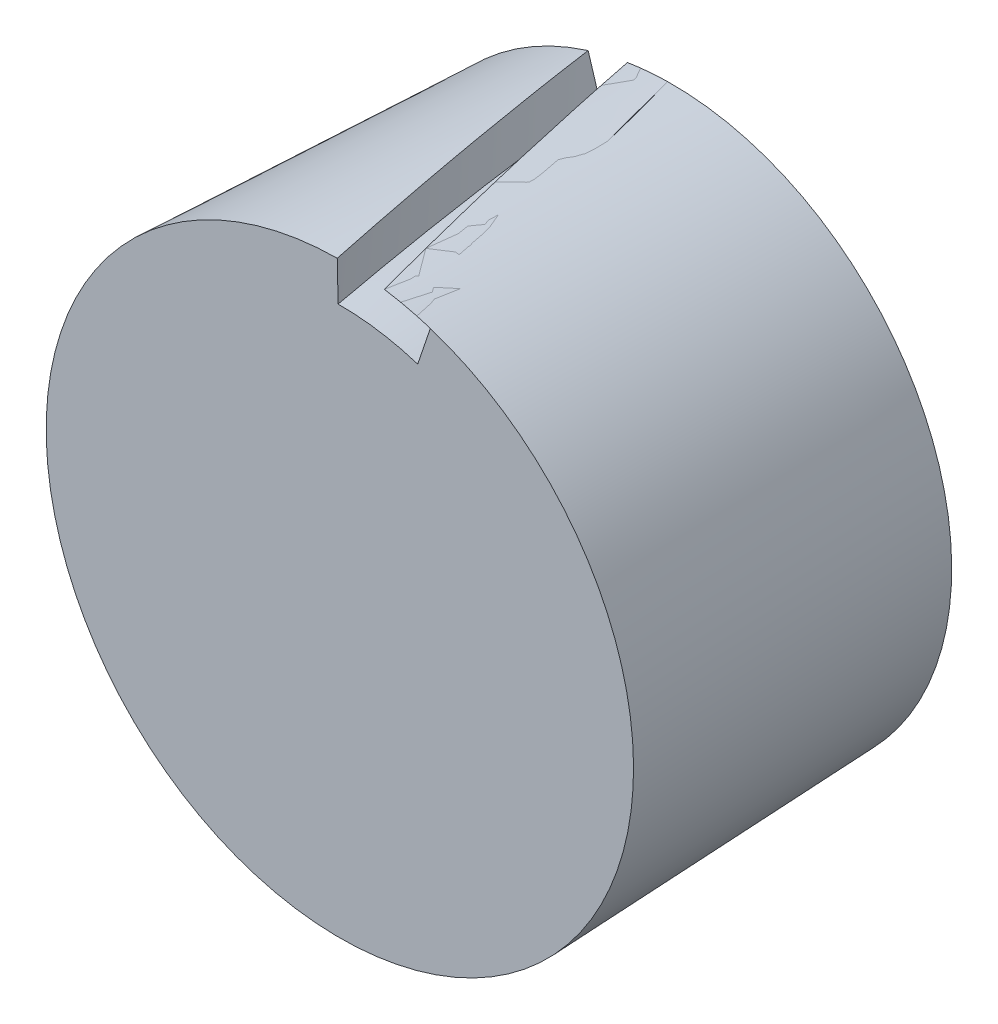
ISO-10303-21;
HEADER;
FILE_DESCRIPTION(('STEP AP214'),'2;1');
FILE_NAME('part.step','',(''),(''),'','','');
FILE_SCHEMA(('AUTOMOTIVE_DESIGN { 1 0 10303 214 1 1 1 1 }'));
ENDSEC;
DATA;
#1=APPLICATION_CONTEXT('core data for automotive mechanical design processes');
#2=APPLICATION_PROTOCOL_DEFINITION('international standard','automotive_design',2000,#1);
#3=PRODUCT_CONTEXT('',#1,'mechanical');
#4=PRODUCT('Part','Part','',(#3));
#5=PRODUCT_RELATED_PRODUCT_CATEGORY('part','',(#4));
#6=PRODUCT_DEFINITION_FORMATION('','',#4);
#7=PRODUCT_DEFINITION_CONTEXT('part definition',#1,'design');
#8=PRODUCT_DEFINITION('design','',#6,#7);
#9=PRODUCT_DEFINITION_SHAPE('','',#8);
#10=(LENGTH_UNIT() NAMED_UNIT(*) SI_UNIT(.MILLI.,.METRE.));
#11=(NAMED_UNIT(*) PLANE_ANGLE_UNIT() SI_UNIT($,.RADIAN.));
#12=(NAMED_UNIT(*) SI_UNIT($,.STERADIAN.) SOLID_ANGLE_UNIT());
#13=UNCERTAINTY_MEASURE_WITH_UNIT(LENGTH_MEASURE(1.E-05),#10,'distance_accuracy_value','');
#14=(GEOMETRIC_REPRESENTATION_CONTEXT(3) GLOBAL_UNCERTAINTY_ASSIGNED_CONTEXT((#13)) GLOBAL_UNIT_ASSIGNED_CONTEXT((#10,
#11,#12)) REPRESENTATION_CONTEXT('',''));
#15=CARTESIAN_POINT('',(0.,0.,0.));
#16=DIRECTION('',(0.,0.,1.));
#17=DIRECTION('',(1.,0.,0.));
#18=AXIS2_PLACEMENT_3D('',#15,#16,#17);
#19=CARTESIAN_POINT('',(0.,0.,63.5));
#20=DIRECTION('',(0.,0.,1.));
#21=DIRECTION('',(1.,0.,0.));
#22=AXIS2_PLACEMENT_3D('',#19,#20,#21);
#23=PLANE('',#22);
#24=DIRECTION('',(0.320823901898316,0.947138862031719,0.));
#25=VECTOR('',#24,1.);
#26=CARTESIAN_POINT('',(34.5958052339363,106.862336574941,63.5));
#27=LINE('',#26,#25);
#28=CARTESIAN_POINT('',(29.7755996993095,92.6320876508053,63.5));
#29=VERTEX_POINT('',#28);
#30=CARTESIAN_POINT('',(34.5958052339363,106.862336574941,63.5));
#31=VERTEX_POINT('',#30);
#32=EDGE_CURVE('E195',#29,#31,#27,.T.);
#33=ORIENTED_EDGE('',*,*,#32,.F.);
#34=CARTESIAN_POINT('',(0.,0.,63.5));
#35=DIRECTION('',(0.,0.,-1.));
#36=DIRECTION('',(1.,0.,0.));
#37=AXIS2_PLACEMENT_3D('',#34,#35,#36);
#38=CIRCLE('',#37,97.3);
#39=CARTESIAN_POINT('',(-0.668973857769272,97.2977002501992,63.5));
#40=VERTEX_POINT('',#39);
#41=EDGE_CURVE('E360',#40,#29,#38,.T.);
#42=ORIENTED_EDGE('',*,*,#41,.F.);
#43=DIRECTION('',(0.0224647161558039,-0.999747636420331,0.));
#44=VECTOR('',#43,1.);
#45=CARTESIAN_POINT('',(-0.668973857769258,97.2977002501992,63.5));
#46=LINE('',#45,#44);
#47=CARTESIAN_POINT('',(-1.0064940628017,112.318367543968,63.5));
#48=VERTEX_POINT('',#47);
#49=EDGE_CURVE('E190',#48,#40,#46,.T.);
#50=ORIENTED_EDGE('',*,*,#49,.F.);
#51=CARTESIAN_POINT('',(0.,0.,63.5));
#52=DIRECTION('',(0.,0.,1.));
#53=DIRECTION('',(1.,0.,0.));
#54=AXIS2_PLACEMENT_3D('',#51,#52,#53);
#55=CIRCLE('',#54,112.32287709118);
#56=EDGE_CURVE('E220',#48,#31,#55,.T.);
#57=ORIENTED_EDGE('',*,*,#56,.T.);
#58=EDGE_LOOP('',(#33,#42,#50,#57));
#59=FACE_BOUND('',#58,.T.);
#60=ADVANCED_FACE('F121',(#59),#23,.T.);
#61=CARTESIAN_POINT('',(0.,0.,-63.5));
#62=DIRECTION('',(0.,0.,1.));
#63=DIRECTION('',(1.,0.,0.));
#64=AXIS2_PLACEMENT_3D('',#61,#62,#63);
#65=CONICAL_SURFACE('',#64,107.,0.041887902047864);
#66=CARTESIAN_POINT('',(-17.0147737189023,105.638522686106,-63.4999999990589));
#67=CARTESIAN_POINT('',(-16.9802353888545,105.644172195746,-63.497961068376));
#68=CARTESIAN_POINT('',(-16.9456863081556,105.649800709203,-63.4960477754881));
#69=CARTESIAN_POINT('',(-16.8765691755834,105.661015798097,-63.4924608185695));
#70=CARTESIAN_POINT('',(-16.8420011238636,105.666602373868,-63.490787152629));
#71=CARTESIAN_POINT('',(-16.7728494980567,105.67773349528,-63.4876678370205));
#72=CARTESIAN_POINT('',(-16.7382659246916,105.683278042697,-63.486222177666));
#73=CARTESIAN_POINT('',(-16.6690843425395,105.694325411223,-63.4835472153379));
#74=CARTESIAN_POINT('',(-16.634486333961,105.699828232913,-63.4823179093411));
#75=CARTESIAN_POINT('',(-16.4110148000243,105.735230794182,-63.4750397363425));
#76=CARTESIAN_POINT('',(-16.2219472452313,105.764534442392,-63.4719351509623));
#77=CARTESIAN_POINT('',(-15.8436073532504,105.82195502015,-63.4699603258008));
#78=CARTESIAN_POINT('',(-15.6543349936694,105.850071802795,-63.4710906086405));
#79=CARTESIAN_POINT('',(-15.2755780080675,105.905194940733,-63.4758109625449));
#80=CARTESIAN_POINT('',(-15.0860933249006,105.932200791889,-63.4794021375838));
#81=CARTESIAN_POINT('',(-14.7070024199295,105.985159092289,-63.4873747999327));
#82=CARTESIAN_POINT('',(-14.5173962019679,106.011111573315,-63.4917562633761));
#83=CARTESIAN_POINT('',(-14.1379875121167,106.06203981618,-63.4997393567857));
#84=CARTESIAN_POINT('',(-13.9481850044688,106.087015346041,-63.5033408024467));
#85=CARTESIAN_POINT('',(-13.6633712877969,106.123786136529,-63.5070757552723));
#86=CARTESIAN_POINT('',(-13.5684162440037,106.135927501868,-63.5080428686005));
#87=CARTESIAN_POINT('',(-13.3784734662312,106.159986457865,-63.5092412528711));
#88=CARTESIAN_POINT('',(-13.2834857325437,106.171904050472,-63.5094725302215));
#89=CARTESIAN_POINT('',(-13.0934798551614,106.195519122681,-63.509105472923));
#90=CARTESIAN_POINT('',(-12.9984617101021,106.207216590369,-63.508507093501));
#91=CARTESIAN_POINT('',(-12.808398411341,106.230370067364,-63.5069761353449));
#92=CARTESIAN_POINT('',(-12.7133532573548,106.241826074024,-63.5060435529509));
#93=CARTESIAN_POINT('',(-12.4281676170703,106.275814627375,-63.5031815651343));
#94=CARTESIAN_POINT('',(-12.2379821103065,106.297967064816,-63.501187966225));
#95=CARTESIAN_POINT('',(-11.8573947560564,106.341221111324,-63.4981690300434));
#96=CARTESIAN_POINT('',(-11.6669928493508,106.362322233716,-63.4971441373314));
#97=CARTESIAN_POINT('',(-11.2860718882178,106.403455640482,-63.4961989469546));
#98=CARTESIAN_POINT('',(-11.0955528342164,106.423487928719,-63.4962786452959));
#99=CARTESIAN_POINT('',(-10.7144313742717,106.462494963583,-63.4971922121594));
#100=CARTESIAN_POINT('',(-10.5238289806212,106.481469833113,-63.4980259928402));
#101=CARTESIAN_POINT('',(-10.2378518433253,106.509161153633,-63.4993480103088));
#102=CARTESIAN_POINT('',(-10.1425140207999,106.518263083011,-63.4998005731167));
#103=CARTESIAN_POINT('',(-9.95181425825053,106.536214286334,-63.5006255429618));
#104=CARTESIAN_POINT('',(-9.85645231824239,106.545063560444,-63.5009979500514));
#105=CARTESIAN_POINT('',(-9.66571272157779,106.562512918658,-63.5015618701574));
#106=CARTESIAN_POINT('',(-9.57033506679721,106.571113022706,-63.501753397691));
#107=CARTESIAN_POINT('',(-9.37955806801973,106.588070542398,-63.5018150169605));
#108=CARTESIAN_POINT('',(-9.2841587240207,106.596427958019,-63.501685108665));
#109=CARTESIAN_POINT('',(-9.09333854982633,106.612894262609,-63.5012422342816));
#110=CARTESIAN_POINT('',(-8.99791771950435,106.621003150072,-63.5009292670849));
#111=CARTESIAN_POINT('',(-8.80705488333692,106.636966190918,-63.50026721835));
#112=CARTESIAN_POINT('',(-8.71161287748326,106.644820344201,-63.4999181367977));
#113=CARTESIAN_POINT('',(-8.42526066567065,106.667994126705,-63.4989623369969));
#114=CARTESIAN_POINT('',(-8.23431849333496,106.682925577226,-63.4984470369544));
#115=CARTESIAN_POINT('',(-7.85235514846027,106.71173743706,-63.4980258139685));
#116=CARTESIAN_POINT('',(-7.66133397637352,106.725617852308,-63.4981198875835));
#117=CARTESIAN_POINT('',(-7.33063336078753,106.748735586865,-63.4987580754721));
#118=CARTESIAN_POINT('',(-7.19097065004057,106.758217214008,-63.4991742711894));
#119=CARTESIAN_POINT('',(-6.91160883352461,106.776625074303,-63.5001780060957));
#120=CARTESIAN_POINT('',(-6.77190972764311,106.785551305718,-63.5007655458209));
#121=CARTESIAN_POINT('',(-6.49247708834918,106.802855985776,-63.5019277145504));
#122=CARTESIAN_POINT('',(-6.35274355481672,106.811234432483,-63.5025023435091));
#123=CARTESIAN_POINT('',(-6.07324492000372,106.827453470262,-63.5033979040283));
#124=CARTESIAN_POINT('',(-5.93347981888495,106.83529406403,-63.5037188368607));
#125=CARTESIAN_POINT('',(-5.7238251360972,106.846659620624,-63.503796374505));
#126=CARTESIAN_POINT('',(-5.65394632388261,106.850381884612,-63.5037549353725));
#127=CARTESIAN_POINT('',(-5.51418223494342,106.8576966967,-63.503495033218));
#128=CARTESIAN_POINT('',(-5.44429695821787,106.861289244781,-63.5032765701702));
#129=CARTESIAN_POINT('',(-5.2346312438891,106.871868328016,-63.5024509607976));
#130=CARTESIAN_POINT('',(-5.09484148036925,106.878656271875,-63.501673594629));
#131=CARTESIAN_POINT('',(-4.81523580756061,106.891686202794,-63.5000571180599));
#132=CARTESIAN_POINT('',(-4.67541989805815,106.897928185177,-63.4992180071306));
#133=CARTESIAN_POINT('',(-4.39576369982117,106.909855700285,-63.497725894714));
#134=CARTESIAN_POINT('',(-4.25592341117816,106.915541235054,-63.4970728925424));
#135=CARTESIAN_POINT('',(-4.02413216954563,106.924498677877,-63.4962547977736));
#136=CARTESIAN_POINT('',(-3.93218767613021,106.927930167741,-63.4959991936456));
#137=CARTESIAN_POINT('',(-3.74829044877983,106.934549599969,-63.4956391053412));
#138=CARTESIAN_POINT('',(-3.65633771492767,106.937737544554,-63.4955346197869));
#139=CARTESIAN_POINT('',(-3.47242601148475,106.943869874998,-63.4954755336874));
#140=CARTESIAN_POINT('',(-3.38046704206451,106.946814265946,-63.4955209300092));
#141=CARTESIAN_POINT('',(-3.19652731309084,106.952460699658,-63.495744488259));
#142=CARTESIAN_POINT('',(-3.10454655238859,106.955162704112,-63.4959226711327));
#143=CARTESIAN_POINT('',(-2.92057697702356,106.960325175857,-63.4963805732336));
#144=CARTESIAN_POINT('',(-2.82858816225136,106.962785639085,-63.4966602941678));
#145=CARTESIAN_POINT('',(-2.64459922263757,106.967466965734,-63.4972767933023));
#146=CARTESIAN_POINT('',(-2.55259909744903,106.969687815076,-63.4976135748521));
#147=CARTESIAN_POINT('',(-2.41475836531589,106.972837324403,-63.4981179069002));
#148=CARTESIAN_POINT('',(-2.36891977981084,106.973855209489,-63.4982855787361));
#149=CARTESIAN_POINT('',(-2.27724393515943,106.975832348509,-63.4986125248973));
#150=CARTESIAN_POINT('',(-2.23140667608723,106.976791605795,-63.4987717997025));
#151=CARTESIAN_POINT('',(-2.13973832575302,106.978651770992,-63.4990731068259));
#152=CARTESIAN_POINT('',(-2.09390723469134,106.979552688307,-63.4992151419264));
#153=CARTESIAN_POINT('',(-2.02517829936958,106.98086037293,-63.4994081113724));
#154=CARTESIAN_POINT('',(-2.00228089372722,106.98128882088,-63.4994690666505));
#155=CARTESIAN_POINT('',(-1.95648558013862,106.982131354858,-63.4995829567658));
#156=CARTESIAN_POINT('',(-1.93358767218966,106.98254544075,-63.499635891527));
#157=CARTESIAN_POINT('',(-1.88778720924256,106.983359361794,-63.4997328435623));
#158=CARTESIAN_POINT('',(-1.86488465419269,106.983759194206,-63.4997768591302));
#159=CARTESIAN_POINT('',(-1.81908012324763,106.984544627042,-63.4998531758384));
#160=CARTESIAN_POINT('',(-1.79617814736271,106.984930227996,-63.4998854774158));
#161=CARTESIAN_POINT('',(-1.75036047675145,106.985687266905,-63.4999424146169));
#162=CARTESIAN_POINT('',(-1.72744478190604,106.986058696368,-63.4999670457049));
#163=CARTESIAN_POINT('',(-1.69306949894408,106.986605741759,-63.4999820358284));
#164=CARTESIAN_POINT('',(-1.68161006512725,106.986786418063,-63.4999833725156));
#165=CARTESIAN_POINT('',(-1.65869083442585,106.987143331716,-63.5000042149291));
#166=CARTESIAN_POINT('',(-1.6472310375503,106.987319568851,-63.5000237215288));
#167=CARTESIAN_POINT('',(-1.63160971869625,106.987559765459,-63.4999913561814));
#168=CARTESIAN_POINT('',(-1.62744862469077,106.98762374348,-63.4999770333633));
#169=CARTESIAN_POINT('',(-1.61912851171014,106.987755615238,-63.4998426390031));
#170=CARTESIAN_POINT('',(-1.61496949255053,106.987823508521,-63.4997225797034));
#171=CARTESIAN_POINT('',(-1.60250063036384,106.988031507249,-63.4992390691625));
#172=CARTESIAN_POINT('',(-1.59419548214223,106.988175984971,-63.4987522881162));
#173=CARTESIAN_POINT('',(-1.5776380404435,106.988475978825,-63.4974506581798));
#174=CARTESIAN_POINT('',(-1.56938566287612,106.988631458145,-63.4966368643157));
#175=CARTESIAN_POINT('',(-1.55291471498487,106.988952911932,-63.4947017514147));
#176=CARTESIAN_POINT('',(-1.54469615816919,106.989118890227,-63.4935803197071));
#177=CARTESIAN_POINT('',(-1.52012693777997,106.98963099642,-63.4897808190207));
#178=CARTESIAN_POINT('',(-1.50384261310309,106.989991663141,-63.4866658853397));
#179=CARTESIAN_POINT('',(-1.47165572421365,106.990742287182,-63.4794355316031));
#180=CARTESIAN_POINT('',(-1.45575104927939,106.991131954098,-63.475329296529));
#181=CARTESIAN_POINT('',(-1.42416063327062,106.991939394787,-63.4662093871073));
#182=CARTESIAN_POINT('',(-1.40847557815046,106.992357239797,-63.4611933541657));
#183=CARTESIAN_POINT('',(-1.37736871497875,106.99321613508,-63.4503641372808));
#184=CARTESIAN_POINT('',(-1.36194719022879,106.993657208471,-63.4445501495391));
#185=CARTESIAN_POINT('',(-1.30926910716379,106.995210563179,-63.4233092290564));
#186=CARTESIAN_POINT('',(-1.27270839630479,106.996370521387,-63.4061461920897));
#187=CARTESIAN_POINT('',(-1.2012429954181,106.998762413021,-63.3687924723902));
#188=CARTESIAN_POINT('',(-1.1663373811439,106.999994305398,-63.3486035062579));
#189=CARTESIAN_POINT('',(-1.09743012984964,107.002525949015,-63.3055981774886));
#190=CARTESIAN_POINT('',(-1.06345140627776,107.003826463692,-63.2827454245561));
#191=CARTESIAN_POINT('',(-0.996800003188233,107.006460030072,-63.235221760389));
#192=CARTESIAN_POINT('',(-0.964127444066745,107.007793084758,-63.2105506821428));
#193=CARTESIAN_POINT('',(-0.886058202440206,107.01106050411,-63.1488185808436));
#194=CARTESIAN_POINT('',(-0.841257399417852,107.013006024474,-63.111006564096));
#195=CARTESIAN_POINT('',(-0.753570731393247,107.016920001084,-63.0332132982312));
#196=CARTESIAN_POINT('',(-0.710685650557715,107.018888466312,-62.9932311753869));
#197=CARTESIAN_POINT('',(-0.626433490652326,107.022839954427,-62.9115117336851));
#198=CARTESIAN_POINT('',(-0.58507021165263,107.02482300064,-62.8697705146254));
#199=CARTESIAN_POINT('',(-0.503720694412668,107.028791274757,-62.7849636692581));
#200=CARTESIAN_POINT('',(-0.463734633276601,107.030776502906,-62.7418978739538));
#201=CARTESIAN_POINT('',(-0.345446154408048,107.036732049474,-62.6109952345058));
#202=CARTESIAN_POINT('',(-0.268916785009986,107.040697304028,-62.521555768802));
#203=CARTESIAN_POINT('',(-0.119320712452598,107.048597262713,-62.3395414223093));
#204=CARTESIAN_POINT('',(-0.0462617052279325,107.052531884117,-62.2469602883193));
#205=CARTESIAN_POINT('',(0.0968294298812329,107.060343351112,-62.0597757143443));
#206=CARTESIAN_POINT('',(0.166867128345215,107.064220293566,-61.9651765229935));
#207=CARTESIAN_POINT('',(0.304533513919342,107.071915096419,-61.7743515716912));
#208=CARTESIAN_POINT('',(0.372163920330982,107.075732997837,-61.6781270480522));
#209=CARTESIAN_POINT('',(0.559723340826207,107.086393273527,-61.4054489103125));
#210=CARTESIAN_POINT('',(0.677409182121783,107.093167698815,-61.2274502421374));
#211=CARTESIAN_POINT('',(0.907965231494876,107.106517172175,-60.8682329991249));
#212=CARTESIAN_POINT('',(1.02083259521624,107.113092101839,-60.6870126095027));
#213=CARTESIAN_POINT('',(1.24278793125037,107.126044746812,-60.3220406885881));
#214=CARTESIAN_POINT('',(1.35187230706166,107.132422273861,-60.1382869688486));
#215=CARTESIAN_POINT('',(1.5669539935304,107.144981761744,-59.7687596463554));
#216=CARTESIAN_POINT('',(1.67294844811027,107.151163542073,-59.5829843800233));
#217=CARTESIAN_POINT('',(1.88233230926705,107.163333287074,-59.2098007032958));
#218=CARTESIAN_POINT('',(1.98571988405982,107.169321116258,-59.0223912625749));
#219=CARTESIAN_POINT('',(2.19023986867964,107.181104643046,-58.646250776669));
#220=CARTESIAN_POINT('',(2.29137142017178,107.186900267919,-58.4575192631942));
#221=CARTESIAN_POINT('',(2.48504001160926,107.197925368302,-58.0914674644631));
#222=CARTESIAN_POINT('',(2.57770425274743,107.20316698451,-57.9142147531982));
#223=CARTESIAN_POINT('',(2.761450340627,107.213485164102,-57.5589732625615));
#224=CARTESIAN_POINT('',(2.85253278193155,107.218561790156,-57.3809847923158));
#225=CARTESIAN_POINT('',(3.03323239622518,107.228550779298,-57.0244566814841));
#226=CARTESIAN_POINT('',(3.12285077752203,107.233463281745,-56.8459176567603));
#227=CARTESIAN_POINT('',(3.30071224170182,107.243124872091,-56.4884597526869));
#228=CARTESIAN_POINT('',(3.38895705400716,107.247874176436,-56.3095417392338));
#229=CARTESIAN_POINT('',(3.56414170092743,107.257210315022,-55.9514876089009));
#230=CARTESIAN_POINT('',(3.65108370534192,107.261797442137,-55.7723525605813));
#231=CARTESIAN_POINT('',(3.8237133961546,107.270810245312,-55.4140158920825));
#232=CARTESIAN_POINT('',(3.90940363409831,107.275236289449,-55.2348155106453));
#233=CARTESIAN_POINT('',(3.99462016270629,107.279588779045,-55.0553890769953));
#234=B_SPLINE_CURVE_WITH_KNOTS('',3,(#66,#67,#68,#69,#70,#71,#72,#73,#74,#75,#76,#77,#78,#79,
#80,#81,#82,#83,#84,#85,#86,#87,#88,#89,#90,#91,#92,#93,#94,#95,#96,#97,#98,#99,#100,#101,#102,
#103,#104,#105,#106,#107,#108,#109,#110,#111,#112,#113,#114,#115,#116,#117,#118,#119,#120,#121,
#122,#123,#124,#125,#126,#127,#128,#129,#130,#131,#132,#133,#134,#135,#136,#137,#138,#139,#140,
#141,#142,#143,#144,#145,#146,#147,#148,#149,#150,#151,#152,#153,#154,#155,#156,#157,#158,#159,
#160,#161,#162,#163,#164,#165,#166,#167,#168,#169,#170,#171,#172,#173,#174,#175,#176,#177,#178,
#179,#180,#181,#182,#183,#184,#185,#186,#187,#188,#189,#190,#191,#192,#193,#194,#195,#196,#197,
#198,#199,#200,#201,#202,#203,#204,#205,#206,#207,#208,#209,#210,#211,#212,#213,#214,#215,#216,
#217,#218,#219,#220,#221,#222,#223,#224,#225,#226,#227,#228,#229,#230,#231,#232,#233),
.UNSPECIFIED.,.F.,.F.,(4,2,2,2,2,2,2,2,2,2,2,2,2,2,2,2,2,2,2,2,2,2,2,2,2,2,2,2,2,2,2,2,2,2,2,2,
2,2,2,2,2,2,2,2,2,2,2,2,2,2,2,2,2,2,2,2,2,2,2,2,2,2,2,2,2,2,2,2,2,2,2,2,2,2,2,2,2,2,2,2,2,2,2,
4),(0.,0.105169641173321,0.210338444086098,0.315502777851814,0.420665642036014,
0.994626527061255,1.56865824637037,2.14294764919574,2.71721971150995,3.2916273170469,
3.57882393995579,3.86601806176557,4.15322768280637,4.44044044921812,5.01488157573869,
5.58958619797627,6.16428874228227,6.73892434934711,7.02624126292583,7.31355798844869,
7.60085165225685,7.88814534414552,8.17544077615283,8.46273631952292,9.03731002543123,
9.61188048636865,10.031833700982,10.4517882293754,10.8717442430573,11.2916981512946,
11.5016315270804,11.7115649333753,12.1314334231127,12.5513055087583,12.9711760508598,
13.2472022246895,13.5232258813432,13.7992437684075,14.0753052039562,14.3513712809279,
14.6274535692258,14.765004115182,14.9025467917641,15.0400672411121,15.1087717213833,
15.1774768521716,15.2461951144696,15.3149108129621,15.3836670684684,15.4180494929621,
15.4524335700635,15.4649178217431,15.4774006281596,15.5023557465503,15.5272309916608,
15.5521153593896,15.6018236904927,15.651088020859,15.7004819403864,15.7499259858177,
15.8709186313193,15.9918428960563,16.1146727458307,16.2375138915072,16.4133844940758,
16.5893264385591,16.7656814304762,16.9420590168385,17.2952507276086,17.6491922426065,
18.0024505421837,18.355451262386,18.9958104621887,19.6365425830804,20.2778680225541,
20.9197685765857,21.5621082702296,22.2046883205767,22.8049247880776,23.4049305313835,
24.0044131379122,24.6030672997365,25.2005785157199,25.7966255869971),.UNSPECIFIED.);
#235=CARTESIAN_POINT('',(-4.80650126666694,106.891997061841,-63.5));
#236=VERTEX_POINT('',#235);
#237=CARTESIAN_POINT('',(-1.63357644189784,106.987529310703,-63.5));
#238=VERTEX_POINT('',#237);
#239=EDGE_CURVE('E218',#236,#238,#234,.T.);
#240=ORIENTED_EDGE('',*,*,#239,.F.);
#241=CARTESIAN_POINT('',(0.,0.,-63.5));
#242=DIRECTION('',(0.,0.,-1.));
#243=DIRECTION('',(-1.,0.,0.));
#244=AXIS2_PLACEMENT_3D('',#241,#242,#243);
#245=CIRCLE('',#244,107.);
#246=CARTESIAN_POINT('',(-6.96394887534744,106.773148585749,-63.5));
#247=VERTEX_POINT('',#246);
#248=EDGE_CURVE('E327',#247,#236,#245,.T.);
#249=ORIENTED_EDGE('',*,*,#248,.F.);
#250=CARTESIAN_POINT('',(-17.014773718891,105.638522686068,-63.5));
#251=VERTEX_POINT('',#250);
#252=EDGE_CURVE('E221',#251,#247,#234,.T.);
#253=ORIENTED_EDGE('',*,*,#252,.F.);
#254=CARTESIAN_POINT('',(-17.0147737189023,105.638522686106,-63.4999999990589));
#255=CARTESIAN_POINT('',(-16.9786178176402,105.650075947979,-63.3650308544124));
#256=CARTESIAN_POINT('',(-16.9424615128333,105.661609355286,-63.2300600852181));
#257=CARTESIAN_POINT('',(-15.3290188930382,106.175386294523,-57.20710568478));
#258=CARTESIAN_POINT('',(-13.750966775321,106.639896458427,-51.3160467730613));
#259=CARTESIAN_POINT('',(-10.5934614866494,107.496069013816,-39.5289740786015));
#260=CARTESIAN_POINT('',(-9.0140082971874,107.887730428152,-33.6329602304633));
#261=CARTESIAN_POINT('',(-5.85389746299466,108.600315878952,-21.8371020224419));
#262=CARTESIAN_POINT('',(-4.27323984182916,108.921241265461,-15.9372577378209));
#263=CARTESIAN_POINT('',(-1.1108776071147,109.494029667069,-4.13447273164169));
#264=CARTESIAN_POINT('',(0.470827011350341,109.745892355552,1.76846800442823));
#265=CARTESIAN_POINT('',(3.29029831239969,110.134316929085,12.2900984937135));
#266=CARTESIAN_POINT('',(4.52790782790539,110.284044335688,16.9083477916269));
#267=CARTESIAN_POINT('',(7.00350278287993,110.542463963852,26.1458958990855));
#268=CARTESIAN_POINT('',(8.24148822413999,110.651155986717,30.7651947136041));
#269=CARTESIAN_POINT('',(11.9557723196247,110.916198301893,44.6240079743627));
#270=CARTESIAN_POINT('',(14.4324732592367,111.011525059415,53.8647172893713));
#271=CARTESIAN_POINT('',(16.9442588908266,111.026324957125,63.2368891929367));
#272=CARTESIAN_POINT('',(16.9795163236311,111.026516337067,63.3684446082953));
#273=CARTESIAN_POINT('',(17.0147737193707,111.026691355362,63.4999999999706));
#274=B_SPLINE_CURVE_WITH_KNOTS('',3,(#254,#255,#256,#257,#258,#259,#260,#261,#262,#263,#264,
#265,#266,#267,#268,#269,#270,#271,#272,#273),.UNSPECIFIED.,.F.,.F.,(4,2,2,2,2,2,2,2,2,4),(0.,
0.420614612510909,18.7693402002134,37.1183118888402,55.4669333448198,73.8156415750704,
88.1660993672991,102.516626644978,131.216817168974,131.625411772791),.UNSPECIFIED.);
#275=CARTESIAN_POINT('',(17.0147737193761,111.026691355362,63.5));
#276=VERTEX_POINT('',#275);
#277=EDGE_CURVE('E394',#276,#251,#274,.F.);
#278=ORIENTED_EDGE('',*,*,#277,.F.);
#279=CARTESIAN_POINT('',(34.5958052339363,106.862336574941,63.5));
#280=CARTESIAN_POINT('',(33.2132379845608,107.309931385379,63.5));
#281=CARTESIAN_POINT('',(30.3824639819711,108.166913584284,63.5));
#282=CARTESIAN_POINT('',(25.9862066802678,109.30747819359,63.5));
#283=CARTESIAN_POINT('',(21.5030940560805,110.277212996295,63.5));
#284=CARTESIAN_POINT('',(18.5046331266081,110.79837129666,63.5));
#285=CARTESIAN_POINT('',(15.5249143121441,111.255011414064,63.5));
#286=CARTESIAN_POINT('',(12.507992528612,111.655706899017,63.4999999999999));
#287=CARTESIAN_POINT('',(7.94022079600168,112.0730146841,63.5));
#288=CARTESIAN_POINT('',(3.40416066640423,112.301322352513,63.5));
#289=CARTESIAN_POINT('',(0.44666241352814,112.331389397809,63.5));
#290=CARTESIAN_POINT('',(-1.0064940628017,112.318367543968,63.5));
#291=B_SPLINE_CURVE_WITH_KNOTS('',3,(#279,#280,#281,#282,#283,#284,#285,#286,#287,#288,#289,
#290),.UNSPECIFIED.,.F.,.F.,(4,1,1,1,2,1,1,1,4),(0.6376246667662,0.682921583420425,
0.72821850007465,0.773515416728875,0.8188123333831,0.864109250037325,0.90940616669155,
0.954703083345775,1.),.UNSPECIFIED.);
#292=CARTESIAN_POINT('',(29.4366804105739,108.397009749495,63.5));
#293=VERTEX_POINT('',#292);
#294=EDGE_CURVE('E147',#293,#276,#291,.T.);
#295=ORIENTED_EDGE('',*,*,#294,.F.);
#296=CARTESIAN_POINT('',(17.0147737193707,111.026691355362,63.4999999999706));
#297=CARTESIAN_POINT('',(17.1492705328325,111.006389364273,63.5072942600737));
#298=CARTESIAN_POINT('',(17.2837882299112,110.985773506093,63.5131675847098));
#299=CARTESIAN_POINT('',(17.669117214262,110.925852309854,63.5264795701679));
#300=CARTESIAN_POINT('',(17.9199215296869,110.885798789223,63.5308812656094));
#301=CARTESIAN_POINT('',(18.2959062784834,110.824253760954,63.5329824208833));
#302=CARTESIAN_POINT('',(18.4212092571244,110.803492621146,63.5329323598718));
#303=CARTESIAN_POINT('',(18.6717306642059,110.761498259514,63.5316687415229));
#304=CARTESIAN_POINT('',(18.7969490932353,110.740265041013,63.5304551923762));
#305=CARTESIAN_POINT('',(19.0473801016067,110.697327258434,63.5271978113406));
#306=CARTESIAN_POINT('',(19.172592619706,110.67562238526,63.5251534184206));
#307=CARTESIAN_POINT('',(19.4229316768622,110.631768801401,63.520570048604));
#308=CARTESIAN_POINT('',(19.5480582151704,110.609620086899,63.5180310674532));
#309=CARTESIAN_POINT('',(19.798219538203,110.564894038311,63.5127905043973));
#310=CARTESIAN_POINT('',(19.9232543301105,110.542316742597,63.5100889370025));
#311=CARTESIAN_POINT('',(20.173247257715,110.496744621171,63.5048447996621));
#312=CARTESIAN_POINT('',(20.2982053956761,110.473749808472,63.5023022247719));
#313=CARTESIAN_POINT('',(20.5485509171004,110.42726241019,63.4976886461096));
#314=CARTESIAN_POINT('',(20.6739380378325,110.403768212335,63.4956195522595));
#315=CARTESIAN_POINT('',(20.9246465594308,110.356382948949,63.4922572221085));
#316=CARTESIAN_POINT('',(21.0499679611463,110.332491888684,63.490963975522));
#317=CARTESIAN_POINT('',(21.300549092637,110.284325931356,63.4894791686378));
#318=CARTESIAN_POINT('',(21.4258088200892,110.260051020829,63.4892876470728));
#319=CARTESIAN_POINT('',(21.6762515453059,110.211125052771,63.4901192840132));
#320=CARTESIAN_POINT('',(21.8014345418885,110.186473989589,63.4911424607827));
#321=CARTESIAN_POINT('',(22.0517220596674,110.136759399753,63.4935445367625));
#322=CARTESIAN_POINT('',(22.1768265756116,110.111695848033,63.4949234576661));
#323=CARTESIAN_POINT('',(22.4269488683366,110.061140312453,63.4976257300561));
#324=CARTESIAN_POINT('',(22.5519666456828,110.035648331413,63.4989490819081));
#325=CARTESIAN_POINT('',(22.9269184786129,109.958505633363,63.5024110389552));
#326=CARTESIAN_POINT('',(23.1767223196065,109.906193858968,63.5040411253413));
#327=CARTESIAN_POINT('',(23.6759436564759,109.799791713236,63.5053866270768));
#328=CARTESIAN_POINT('',(23.925361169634,109.745701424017,63.5051021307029));
#329=CARTESIAN_POINT('',(24.4238055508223,109.635770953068,63.5032603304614));
#330=CARTESIAN_POINT('',(24.6728324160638,109.579930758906,63.5017030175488));
#331=CARTESIAN_POINT('',(25.1082092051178,109.480744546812,63.4989669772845));
#332=CARTESIAN_POINT('',(25.2946438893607,109.437770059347,63.4977910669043));
#333=CARTESIAN_POINT('',(25.5741359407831,109.372614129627,63.4965250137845));
#334=CARTESIAN_POINT('',(25.6672730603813,109.350779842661,63.4961859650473));
#335=CARTESIAN_POINT('',(25.8534943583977,109.306884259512,63.4957779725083));
#336=CARTESIAN_POINT('',(25.9465785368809,109.284822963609,63.4957090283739));
#337=CARTESIAN_POINT('',(26.1326936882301,109.240475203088,63.4958825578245));
#338=CARTESIAN_POINT('',(26.2257246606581,109.218188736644,63.4961250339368));
#339=CARTESIAN_POINT('',(26.4117304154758,109.17338479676,63.4967693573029));
#340=CARTESIAN_POINT('',(26.5047051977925,109.150867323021,63.4971712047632));
#341=CARTESIAN_POINT('',(26.7835444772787,109.082962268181,63.4984693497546));
#342=CARTESIAN_POINT('',(26.9693228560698,109.037222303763,63.4994582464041));
#343=CARTESIAN_POINT('',(27.3406257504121,108.944785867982,63.5011541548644));
#344=CARTESIAN_POINT('',(27.5261502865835,108.898089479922,63.5018611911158));
#345=CARTESIAN_POINT('',(27.8969542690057,108.803728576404,63.5027711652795));
#346=CARTESIAN_POINT('',(28.0822337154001,108.756064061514,63.5029741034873));
#347=CARTESIAN_POINT('',(28.4525383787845,108.659768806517,63.5028655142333));
#348=CARTESIAN_POINT('',(28.6375635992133,108.611138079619,63.5025539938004));
#349=CARTESIAN_POINT('',(29.0073582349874,108.512917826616,63.5015772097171));
#350=CARTESIAN_POINT('',(29.192127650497,108.463328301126,63.5009119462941));
#351=CARTESIAN_POINT('',(29.4689878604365,108.388262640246,63.4998806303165));
#352=CARTESIAN_POINT('',(29.5611750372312,108.363141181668,63.4995314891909));
#353=CARTESIAN_POINT('',(29.7454853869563,108.312664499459,63.4988682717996));
#354=CARTESIAN_POINT('',(29.8376085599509,108.287309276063,63.4985541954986));
#355=CARTESIAN_POINT('',(30.1138833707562,108.2108973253,63.4977733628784));
#356=CARTESIAN_POINT('',(30.2979399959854,108.159494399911,63.4974680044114));
#357=CARTESIAN_POINT('',(30.6658025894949,108.055776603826,63.4975642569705));
#358=CARTESIAN_POINT('',(30.8496085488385,108.003461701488,63.4979658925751));
#359=CARTESIAN_POINT('',(31.2169640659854,107.89789729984,63.4989212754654));
#360=CARTESIAN_POINT('',(31.4005136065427,107.844647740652,63.4994750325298));
#361=CARTESIAN_POINT('',(31.7674755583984,107.737167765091,63.5004803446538));
#362=CARTESIAN_POINT('',(31.9508877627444,107.682936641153,63.500931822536));
#363=CARTESIAN_POINT('',(32.3174266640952,107.573528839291,63.5015799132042));
#364=CARTESIAN_POINT('',(32.5005533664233,107.518352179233,63.5017765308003));
#365=CARTESIAN_POINT('',(32.866496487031,107.40705988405,63.5018921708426));
#366=CARTESIAN_POINT('',(33.0493129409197,107.350944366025,63.5018112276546));
#367=CARTESIAN_POINT('',(33.4146123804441,107.237785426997,63.5014520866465));
#368=CARTESIAN_POINT('',(33.5970954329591,107.180742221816,63.5011739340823));
#369=CARTESIAN_POINT('',(33.8273328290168,107.108125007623,63.500812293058));
#370=CARTESIAN_POINT('',(33.8752242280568,107.092984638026,63.5007364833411));
#371=CARTESIAN_POINT('',(33.9709979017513,107.062636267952,63.5005885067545));
#372=CARTESIAN_POINT('',(34.0188801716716,107.047428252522,63.5005163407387));
#373=CARTESIAN_POINT('',(34.1146506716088,107.016939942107,63.5003802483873));
#374=CARTESIAN_POINT('',(34.1625388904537,107.001659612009,63.5003163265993));
#375=CARTESIAN_POINT('',(34.2343333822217,106.978698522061,63.5002305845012));
#376=CARTESIAN_POINT('',(34.2582473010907,106.971041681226,63.5002037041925));
#377=CARTESIAN_POINT('',(34.3060676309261,106.955712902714,63.5001540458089));
#378=CARTESIAN_POINT('',(34.3299740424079,106.948040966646,63.5001312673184));
#379=CARTESIAN_POINT('',(34.3777663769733,106.932686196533,63.5000903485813));
#380=CARTESIAN_POINT('',(34.4016523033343,106.925003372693,63.5000722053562));
#381=CARTESIAN_POINT('',(34.4494281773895,106.909619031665,63.5000419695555));
#382=CARTESIAN_POINT('',(34.473318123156,106.901917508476,63.5000298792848));
#383=CARTESIAN_POINT('',(34.5091326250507,106.890358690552,63.5000149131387));
#384=CARTESIAN_POINT('',(34.521059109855,106.88650734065,63.5000104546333));
#385=CARTESIAN_POINT('',(34.54491104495,106.878800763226,63.5000060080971));
#386=CARTESIAN_POINT('',(34.5568364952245,106.874945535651,63.5000060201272));
#387=CARTESIAN_POINT('',(34.5747197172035,106.869160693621,63.4999993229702));
#388=CARTESIAN_POINT('',(34.5806780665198,106.867232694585,63.4999959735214));
#389=CARTESIAN_POINT('',(34.5925946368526,106.86337630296,63.5000043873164));
#390=CARTESIAN_POINT('',(34.5985528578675,106.861447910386,63.5000161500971));
#391=CARTESIAN_POINT('',(34.6164154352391,106.855653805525,63.4997974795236));
#392=CARTESIAN_POINT('',(34.6283147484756,106.851776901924,63.4993134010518));
#393=CARTESIAN_POINT('',(34.6494945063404,106.844846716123,63.497867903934));
#394=CARTESIAN_POINT('',(34.6587850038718,106.841796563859,63.4970322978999));
#395=CARTESIAN_POINT('',(34.6773192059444,106.835690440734,63.4949451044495));
#396=CARTESIAN_POINT('',(34.6865629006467,106.832634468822,63.4936934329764));
#397=CARTESIAN_POINT('',(34.7141703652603,106.823475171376,63.489313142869));
#398=CARTESIAN_POINT('',(34.7324388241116,106.817371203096,63.4855573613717));
#399=CARTESIAN_POINT('',(34.7684243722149,106.805260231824,63.4764078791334));
#400=CARTESIAN_POINT('',(34.7861446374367,106.799252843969,63.4710270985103));
#401=CARTESIAN_POINT('',(34.8210709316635,106.787325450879,63.4586632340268));
#402=CARTESIAN_POINT('',(34.8382763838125,106.781405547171,63.4516784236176));
#403=CARTESIAN_POINT('',(34.871984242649,106.769721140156,63.4362319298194));
#404=CARTESIAN_POINT('',(34.8884888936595,106.763956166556,63.4277754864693));
#405=CARTESIAN_POINT('',(34.9207715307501,106.752595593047,63.409502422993));
#406=CARTESIAN_POINT('',(34.9365498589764,106.746999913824,63.3996864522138));
#407=CARTESIAN_POINT('',(34.9829440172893,106.730422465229,63.3682613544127));
#408=CARTESIAN_POINT('',(35.0124018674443,106.719725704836,63.3447772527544));
#409=CARTESIAN_POINT('',(35.0855812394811,106.692758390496,63.2781892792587));
#410=CARTESIAN_POINT('',(35.1267107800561,106.677182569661,63.2319964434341));
#411=CARTESIAN_POINT('',(35.20175072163,106.648107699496,63.1337472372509));
#412=CARTESIAN_POINT('',(35.2356605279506,106.634608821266,63.0816903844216));
#413=CARTESIAN_POINT('',(35.3058760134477,106.606015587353,62.9600817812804));
#414=CARTESIAN_POINT('',(35.3405378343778,106.591409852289,62.889484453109));
#415=CARTESIAN_POINT('',(35.4033104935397,106.564196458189,62.7450163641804));
#416=CARTESIAN_POINT('',(35.4314086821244,106.551592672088,62.6711396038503));
#417=CARTESIAN_POINT('',(35.4827771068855,106.527861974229,62.520933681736));
#418=CARTESIAN_POINT('',(35.5060121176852,106.516746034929,62.444590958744));
#419=CARTESIAN_POINT('',(35.5485079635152,106.495772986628,62.290737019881));
#420=CARTESIAN_POINT('',(35.5677724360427,106.485914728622,62.2132269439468));
#421=CARTESIAN_POINT('',(35.6074600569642,106.464924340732,62.0383859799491));
#422=CARTESIAN_POINT('',(35.6270212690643,106.454067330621,61.9408284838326));
#423=CARTESIAN_POINT('',(35.6623309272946,106.433582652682,61.7448882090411));
#424=CARTESIAN_POINT('',(35.678078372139,106.423955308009,61.6465052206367));
#425=CARTESIAN_POINT('',(35.7065149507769,106.405686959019,61.4490140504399));
#426=CARTESIAN_POINT('',(35.7191980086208,106.397047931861,61.3499048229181));
#427=CARTESIAN_POINT('',(35.7419978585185,106.380610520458,61.1513190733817));
#428=CARTESIAN_POINT('',(35.7521144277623,106.372812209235,61.0518425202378));
#429=CARTESIAN_POINT('',(35.7792530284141,106.350467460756,60.752855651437));
#430=CARTESIAN_POINT('',(35.7930392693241,106.336987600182,60.5529714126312));
#431=CARTESIAN_POINT('',(35.814209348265,106.312148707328,60.1525187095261));
#432=CARTESIAN_POINT('',(35.8215853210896,106.300792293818,59.9519497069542));
#433=CARTESIAN_POINT('',(35.831280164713,106.279785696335,59.5508841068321));
#434=CARTESIAN_POINT('',(35.8336059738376,106.27013318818,59.3503877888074));
#435=CARTESIAN_POINT('',(35.8341750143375,106.252205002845,58.949399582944));
#436=CARTESIAN_POINT('',(35.8324195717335,106.243928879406,58.7489077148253));
#437=CARTESIAN_POINT('',(35.8262363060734,106.230150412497,58.3902564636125));
#438=CARTESIAN_POINT('',(35.8224507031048,106.224431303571,58.232093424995));
#439=CARTESIAN_POINT('',(35.8130152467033,106.213620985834,57.9157550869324));
#440=CARTESIAN_POINT('',(35.8073648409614,106.208529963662,57.7575797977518));
#441=CARTESIAN_POINT('',(35.7944076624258,106.198906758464,57.4412533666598));
#442=CARTESIAN_POINT('',(35.7871006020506,106.194374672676,57.2831022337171));
#443=CARTESIAN_POINT('',(35.7710785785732,106.185853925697,56.9683861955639));
#444=CARTESIAN_POINT('',(35.7623778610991,106.181860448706,56.8118206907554));
#445=CARTESIAN_POINT('',(35.7436604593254,106.174319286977,56.4987875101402));
#446=CARTESIAN_POINT('',(35.7336440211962,106.170771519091,56.3423198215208));
#447=CARTESIAN_POINT('',(35.7124113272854,106.164083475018,56.0295216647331));
#448=CARTESIAN_POINT('',(35.7011955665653,106.160943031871,55.873191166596));
#449=CARTESIAN_POINT('',(35.68943465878,106.157986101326,55.7168992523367));
#450=B_SPLINE_CURVE_WITH_KNOTS('',3,(#296,#297,#298,#299,#300,#301,#302,#303,#304,#305,#306,
#307,#308,#309,#310,#311,#312,#313,#314,#315,#316,#317,#318,#319,#320,#321,#322,#323,#324,#325,
#326,#327,#328,#329,#330,#331,#332,#333,#334,#335,#336,#337,#338,#339,#340,#341,#342,#343,#344,
#345,#346,#347,#348,#349,#350,#351,#352,#353,#354,#355,#356,#357,#358,#359,#360,#361,#362,#363,
#364,#365,#366,#367,#368,#369,#370,#371,#372,#373,#374,#375,#376,#377,#378,#379,#380,#381,#382,
#383,#384,#385,#386,#387,#388,#389,#390,#391,#392,#393,#394,#395,#396,#397,#398,#399,#400,#401,
#402,#403,#404,#405,#406,#407,#408,#409,#410,#411,#412,#413,#414,#415,#416,#417,#418,#419,#420,
#421,#422,#423,#424,#425,#426,#427,#428,#429,#430,#431,#432,#433,#434,#435,#436,#437,#438,#439,
#440,#441,#442,#443,#444,#445,#446,#447,#448,#449),.UNSPECIFIED.,.F.,.F.,(4,2,2,2,2,2,2,2,2,2,2,
2,2,2,2,2,2,2,2,2,2,2,2,2,2,2,2,2,2,2,2,2,2,2,2,2,2,2,2,2,2,2,2,2,2,2,2,2,2,2,2,2,2,2,2,2,2,2,2,
2,2,2,2,2,2,2,2,2,2,2,2,2,2,2,2,2,4),(0.,0.408628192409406,1.17054919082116,1.55158081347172,
1.93260975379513,2.31389641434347,2.69518635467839,3.076442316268,3.45768641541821,
3.84044227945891,4.22319306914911,4.60595731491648,4.98872731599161,5.37152066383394,
5.75431149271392,6.51998098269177,7.28561516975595,8.05125479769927,8.62523355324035,
8.91222148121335,9.19920905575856,9.48619895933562,9.77318923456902,10.3471730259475,
10.921107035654,11.4950407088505,12.0689665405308,12.6428920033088,12.9295398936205,
13.2161874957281,13.7894836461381,14.3627997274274,14.9361526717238,15.509936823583,
16.083710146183,16.6574124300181,17.2309831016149,17.3816662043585,17.5323844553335,
17.6831854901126,17.75851496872,17.8338368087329,17.9091101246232,17.9844120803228,
18.0220108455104,18.059610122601,18.0783977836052,18.0971848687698,18.1347368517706,
18.1641709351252,18.1936109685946,18.2524017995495,18.3107369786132,18.3691352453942,
18.4273296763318,18.4854964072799,18.6025763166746,18.7928301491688,18.9830996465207,
19.2225193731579,19.4623967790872,19.7039557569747,19.9452924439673,20.2454485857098,
20.5456834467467,20.846508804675,21.1473602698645,21.7496196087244,22.3526168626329,
22.9547851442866,23.5567578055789,24.0316800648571,24.5067431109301,24.9818886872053,
25.452455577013,25.9229345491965,26.3932200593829),.UNSPECIFIED.);
#451=CARTESIAN_POINT('',(31.5921264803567,107.78853359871,63.5));
#452=VERTEX_POINT('',#451);
#453=EDGE_CURVE('E208',#452,#293,#450,.F.);
#454=ORIENTED_EDGE('',*,*,#453,.F.);
#455=CARTESIAN_POINT('',(34.5958052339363,106.862336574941,63.5));
#456=CARTESIAN_POINT('',(33.2132379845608,107.309931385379,63.5));
#457=CARTESIAN_POINT('',(30.3824639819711,108.166913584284,63.5));
#458=CARTESIAN_POINT('',(25.9862066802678,109.30747819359,63.5));
#459=CARTESIAN_POINT('',(21.5030940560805,110.277212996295,63.5));
#460=CARTESIAN_POINT('',(18.5046331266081,110.79837129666,63.5));
#461=CARTESIAN_POINT('',(15.5249143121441,111.255011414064,63.5));
#462=CARTESIAN_POINT('',(12.507992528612,111.655706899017,63.4999999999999));
#463=CARTESIAN_POINT('',(7.94022079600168,112.0730146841,63.5));
#464=CARTESIAN_POINT('',(3.40416066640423,112.301322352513,63.5));
#465=CARTESIAN_POINT('',(0.44666241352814,112.331389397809,63.5));
#466=CARTESIAN_POINT('',(-1.0064940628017,112.318367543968,63.5));
#467=B_SPLINE_CURVE_WITH_KNOTS('',3,(#455,#456,#457,#458,#459,#460,#461,#462,#463,#464,#465,
#466),.UNSPECIFIED.,.F.,.F.,(4,1,1,1,2,1,1,1,4),(0.6376246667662,0.682921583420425,
0.72821850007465,0.773515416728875,0.8188123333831,0.864109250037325,0.90940616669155,
0.954703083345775,1.),.UNSPECIFIED.);
#468=CARTESIAN_POINT('',(34.5953330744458,106.862489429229,63.5));
#469=VERTEX_POINT('',#468);
#470=EDGE_CURVE('E325',#469,#452,#467,.T.);
#471=ORIENTED_EDGE('',*,*,#470,.F.);
#472=CARTESIAN_POINT('',(34.5958052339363,106.862336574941,63.5));
#473=CARTESIAN_POINT('',(33.2132379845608,107.309931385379,63.5));
#474=CARTESIAN_POINT('',(30.3824639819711,108.166913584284,63.5));
#475=CARTESIAN_POINT('',(25.9862066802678,109.30747819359,63.5));
#476=CARTESIAN_POINT('',(21.5030940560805,110.277212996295,63.5));
#477=CARTESIAN_POINT('',(18.5046331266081,110.79837129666,63.5));
#478=CARTESIAN_POINT('',(15.5249143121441,111.255011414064,63.5));
#479=CARTESIAN_POINT('',(12.507992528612,111.655706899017,63.4999999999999));
#480=CARTESIAN_POINT('',(7.94022079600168,112.0730146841,63.5));
#481=CARTESIAN_POINT('',(3.40416066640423,112.301322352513,63.5));
#482=CARTESIAN_POINT('',(0.44666241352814,112.331389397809,63.5));
#483=CARTESIAN_POINT('',(-1.0064940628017,112.318367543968,63.5));
#484=B_SPLINE_CURVE_WITH_KNOTS('',3,(#472,#473,#474,#475,#476,#477,#478,#479,#480,#481,#482,
#483),.UNSPECIFIED.,.F.,.F.,(4,1,1,1,2,1,1,1,4),(0.6376246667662,0.682921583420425,
0.72821850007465,0.773515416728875,0.8188123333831,0.864109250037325,0.90940616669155,
0.954703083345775,1.),.UNSPECIFIED.);
#485=EDGE_CURVE('E131',#31,#469,#484,.T.);
#486=ORIENTED_EDGE('',*,*,#485,.F.);
#487=ORIENTED_EDGE('',*,*,#56,.F.);
#488=CARTESIAN_POINT('',(-32.0416745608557,102.089818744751,-63.5));
#489=CARTESIAN_POINT('',(-31.4500647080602,102.381619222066,-61.0841975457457));
#490=CARTESIAN_POINT('',(-30.8584136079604,102.667227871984,-58.6676629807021));
#491=CARTESIAN_POINT('',(-29.6750426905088,103.226343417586,-53.8332137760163));
#492=CARTESIAN_POINT('',(-29.0833228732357,103.499850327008,-51.4152991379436));
#493=CARTESIAN_POINT('',(-27.3080915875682,104.302636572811,-44.1596545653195));
#494=CARTESIAN_POINT('',(-26.1244956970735,104.814187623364,-39.319972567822));
#495=CARTESIAN_POINT('',(-23.945470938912,105.71419954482,-30.4065829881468));
#496=CARTESIAN_POINT('',(-22.9500697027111,106.109294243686,-26.3335348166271));
#497=CARTESIAN_POINT('',(-20.9590890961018,106.868496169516,-18.1845825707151));
#498=CARTESIAN_POINT('',(-19.9635097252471,107.232603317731,-14.1086784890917));
#499=CARTESIAN_POINT('',(-17.9720763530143,107.930756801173,-5.95426472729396));
#500=CARTESIAN_POINT('',(-16.9762223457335,108.264802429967,-1.8757549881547));
#501=CARTESIAN_POINT('',(-14.9841490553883,108.903629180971,6.28346717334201));
#502=CARTESIAN_POINT('',(-13.9879297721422,109.208410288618,10.3641795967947));
#503=CARTESIAN_POINT('',(-11.994203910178,109.789634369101,18.5306973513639));
#504=CARTESIAN_POINT('',(-10.9966969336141,110.066055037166,22.6165041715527));
#505=CARTESIAN_POINT('',(-9.00099832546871,110.59088498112,30.7897512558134));
#506=CARTESIAN_POINT('',(-8.00280669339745,110.839294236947,34.8771915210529));
#507=CARTESIAN_POINT('',(-6.00558972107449,111.308597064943,43.0532412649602));
#508=CARTESIAN_POINT('',(-5.00656442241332,111.529491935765,47.1418506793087));
#509=CARTESIAN_POINT('',(-3.00741201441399,111.944167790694,55.3201653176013));
#510=CARTESIAN_POINT('',(-2.00728490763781,112.137948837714,59.4098705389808));
#511=CARTESIAN_POINT('',(-1.0064940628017,112.318367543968,63.5));
#512=B_SPLINE_CURVE_WITH_KNOTS('',3,(#488,#489,#490,#491,#492,#493,#494,#495,#496,#497,#498,
#499,#500,#501,#502,#503,#504,#505,#506,#507,#508,#509,#510,#511),.UNSPECIFIED.,.F.,.F.,(4,2,2,
2,2,2,2,2,2,2,2,4),(0.,7.51272201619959,15.0254355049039,30.0507026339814,42.6850617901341,
55.3194530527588,67.9541411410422,80.5888355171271,93.2333917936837,105.877957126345,
118.521925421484,131.16586437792),.UNSPECIFIED.);
#513=CARTESIAN_POINT('',(-32.0416745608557,102.089818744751,-63.5));
#514=VERTEX_POINT('',#513);
#515=EDGE_CURVE('E139',#514,#48,#512,.T.);
#516=ORIENTED_EDGE('',*,*,#515,.F.);
#517=CARTESIAN_POINT('',(0.,0.,-63.5));
#518=DIRECTION('',(0.,0.,1.));
#519=DIRECTION('',(1.,0.,0.));
#520=AXIS2_PLACEMENT_3D('',#517,#518,#519);
#521=CIRCLE('',#520,107.);
#522=EDGE_CURVE('E13',#514,#238,#521,.T.);
#523=ORIENTED_EDGE('',*,*,#522,.T.);
#524=EDGE_LOOP('',(#240,#249,#253,#278,#295,#454,#471,#486,#487,#516,#523));
#525=FACE_BOUND('',#524,.T.);
#526=ADVANCED_FACE('F123',(#525),#65,.T.);
#527=CARTESIAN_POINT('',(0.,0.,-63.5));
#528=DIRECTION('',(0.,0.,1.));
#529=DIRECTION('',(1.,0.,0.));
#530=AXIS2_PLACEMENT_3D('',#527,#528,#529);
#531=PLANE('',#530);
#532=CARTESIAN_POINT('',(0.,0.,-63.5));
#533=DIRECTION('',(0.,0.,1.));
#534=DIRECTION('',(-1.,0.,0.));
#535=AXIS2_PLACEMENT_3D('',#532,#533,#534);
#536=CIRCLE('',#535,92.);
#537=CARTESIAN_POINT('',(-1.29454863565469,91.9908916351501,-63.5));
#538=VERTEX_POINT('',#537);
#539=CARTESIAN_POINT('',(-27.6548155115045,87.7451490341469,-63.5));
#540=VERTEX_POINT('',#539);
#541=EDGE_CURVE('E198',#538,#540,#536,.T.);
#542=ORIENTED_EDGE('',*,*,#541,.F.);
#543=DIRECTION('',(0.0226011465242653,-0.999744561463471,0.));
#544=VECTOR('',#543,1.);
#545=CARTESIAN_POINT('',(-1.63357644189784,106.987529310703,-63.5));
#546=LINE('',#545,#544);
#547=EDGE_CURVE('E203',#238,#538,#546,.T.);
#548=ORIENTED_EDGE('',*,*,#547,.F.);
#549=ORIENTED_EDGE('',*,*,#522,.F.);
#550=DIRECTION('',(-0.292448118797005,0.956281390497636,0.));
#551=VECTOR('',#550,1.);
#552=CARTESIAN_POINT('',(-27.6548155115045,87.7451490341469,-63.5));
#553=LINE('',#552,#551);
#554=EDGE_CURVE('E189',#540,#514,#553,.T.);
#555=ORIENTED_EDGE('',*,*,#554,.F.);
#556=EDGE_LOOP('',(#542,#548,#549,#555));
#557=FACE_BOUND('',#556,.T.);
#558=ADVANCED_FACE('F206',(#557),#531,.F.);
#559=CARTESIAN_POINT('',(-32.0416745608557,102.089818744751,-63.5));
#560=CARTESIAN_POINT('',(-22.0447202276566,107.216219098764,-22.465815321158));
#561=CARTESIAN_POINT('',(-11.5642601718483,110.647174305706,20.372837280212));
#562=CARTESIAN_POINT('',(-1.0064940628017,112.318367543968,63.5));
#563=CARTESIAN_POINT('',(-31.6761029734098,100.894429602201,-63.5));
#564=CARTESIAN_POINT('',(-21.7916302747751,106.002052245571,-22.465815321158));
#565=CARTESIAN_POINT('',(-11.4236518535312,109.414229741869,20.372837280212));
#566=CARTESIAN_POINT('',(-0.978367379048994,111.066645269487,63.5));
#567=CARTESIAN_POINT('',(-30.9449597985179,98.5036513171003,-63.5));
#568=CARTESIAN_POINT('',(-21.2854503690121,103.573718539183,-22.465815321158));
#569=CARTESIAN_POINT('',(-11.142435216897,106.948340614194,20.372837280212));
#570=CARTESIAN_POINT('',(-0.922114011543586,108.563200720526,63.5));
#571=CARTESIAN_POINT('',(-29.8482450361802,94.9174838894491,-63.5));
#572=CARTESIAN_POINT('',(-20.5261805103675,99.9312179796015,-22.465815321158));
#573=CARTESIAN_POINT('',(-10.7206102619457,103.249506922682,20.372837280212));
#574=CARTESIAN_POINT('',(-0.83773396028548,104.808033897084,63.5));
#575=CARTESIAN_POINT('',(-28.7515302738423,91.331316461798,-63.5));
#576=CARTESIAN_POINT('',(-19.7669106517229,96.2887174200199,-22.465815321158));
#577=CARTESIAN_POINT('',(-10.2987853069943,99.5506732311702,20.372837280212));
#578=CARTESIAN_POINT('',(-0.753353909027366,101.052867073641,63.5));
#579=CARTESIAN_POINT('',(-28.0203870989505,88.9405381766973,-63.5));
#580=CARTESIAN_POINT('',(-19.2607307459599,93.8603837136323,-22.465815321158));
#581=CARTESIAN_POINT('',(-10.0175686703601,97.0847841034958,20.372837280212));
#582=CARTESIAN_POINT('',(-0.697100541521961,98.54942252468,63.5));
#583=CARTESIAN_POINT('',(-27.6548155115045,87.7451490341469,-63.5));
#584=CARTESIAN_POINT('',(-19.0076407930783,92.6462168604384,-22.465815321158));
#585=CARTESIAN_POINT('',(-9.87696035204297,95.8518395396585,20.372837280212));
#586=CARTESIAN_POINT('',(-0.668973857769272,97.2977002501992,63.5));
#587=B_SPLINE_SURFACE_WITH_KNOTS('',3,3,((#559,#560,#561,#562),(#563,#564,#565,#566),(#567,#568,
#569,#570),(#571,#572,#573,#574),(#575,#576,#577,#578),(#579,#580,#581,#582),(#583,#584,#585,
#586)),.UNSPECIFIED.,.F.,.F.,.F.,(4,1,1,1,4),(4,4),(0.,0.0407105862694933,0.0814211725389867,
0.12213175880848,0.162842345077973),(0.,1.),.UNSPECIFIED.);
#588=CARTESIAN_POINT('',(-27.6548155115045,87.7451490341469,-63.5));
#589=CARTESIAN_POINT('',(-19.0076407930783,92.6462168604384,-22.465815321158));
#590=CARTESIAN_POINT('',(-9.87696035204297,95.8518395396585,20.372837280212));
#591=CARTESIAN_POINT('',(-0.668973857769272,97.2977002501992,63.5));
#592=B_SPLINE_CURVE_WITH_KNOTS('',3,(#588,#589,#590,#591),.UNSPECIFIED.,.F.,.F.,(4,4),(0.,1.),.UNSPECIFIED.);
#593=EDGE_CURVE('E185',#540,#40,#592,.T.);
#594=ORIENTED_EDGE('',*,*,#515,.T.);
#595=ORIENTED_EDGE('',*,*,#49,.T.);
#596=ORIENTED_EDGE('',*,*,#593,.F.);
#597=ORIENTED_EDGE('',*,*,#554,.T.);
#598=EDGE_LOOP('',(#594,#595,#596,#597));
#599=FACE_BOUND('',#598,.T.);
#600=ADVANCED_FACE('F187',(#599),#587,.F.);
#601=CARTESIAN_POINT('',(-27.6548155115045,87.7451490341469,-63.5));
#602=CARTESIAN_POINT('',(-19.0076407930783,92.6462168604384,-22.465815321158));
#603=CARTESIAN_POINT('',(-9.87696035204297,95.8518395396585,20.372837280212));
#604=CARTESIAN_POINT('',(-0.668973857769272,97.2977002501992,63.5));
#605=CARTESIAN_POINT('',(-25.5251993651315,88.416344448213,-63.5));
#606=CARTESIAN_POINT('',(-16.7287485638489,93.0995875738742,-22.465815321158));
#607=CARTESIAN_POINT('',(-7.44879203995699,96.087385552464,20.372837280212));
#608=CARTESIAN_POINT('',(1.90847053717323,97.3154215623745,63.5));
#609=CARTESIAN_POINT('',(-21.2170776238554,89.6036130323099,-63.4999999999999));
#610=CARTESIAN_POINT('',(-12.1379018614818,93.8346045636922,-22.4658153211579));
#611=CARTESIAN_POINT('',(-2.57522037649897,96.3701509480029,20.372837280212));
#612=CARTESIAN_POINT('',(7.06476716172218,97.1459353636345,63.5));
#613=CARTESIAN_POINT('',(-14.642457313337,90.9096755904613,-63.5000000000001));
#614=CARTESIAN_POINT('',(-5.19153833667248,94.4161566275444,-22.465815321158));
#615=CARTESIAN_POINT('',(4.74288636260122,96.227192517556,20.372837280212));
#616=CARTESIAN_POINT('',(14.7546171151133,96.2784664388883,63.5000000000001));
#617=CARTESIAN_POINT('',(-7.9902462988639,91.7340057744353,-63.4999999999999));
#618=CARTESIAN_POINT('',(1.77550811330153,94.4739806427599,-22.465815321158));
#619=CARTESIAN_POINT('',(12.0247682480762,95.518510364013,20.372837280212));
#620=CARTESIAN_POINT('',(22.3513344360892,94.8032781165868,63.5));
#621=CARTESIAN_POINT('',(-3.52721095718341,91.9594723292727,-63.5));
#622=CARTESIAN_POINT('',(6.40766977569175,94.1634829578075,-22.465815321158));
#623=CARTESIAN_POINT('',(16.8260562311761,94.6720484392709,20.372837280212));
#624=CARTESIAN_POINT('',(27.3217487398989,93.4208519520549,63.5));
#625=CARTESIAN_POINT('',(-1.29454863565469,91.9908916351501,-63.5));
#626=CARTESIAN_POINT('',(8.7140616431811,93.9215077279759,-22.465815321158));
#627=CARTESIAN_POINT('',(19.2061776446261,94.1566786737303,20.372837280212));
#628=CARTESIAN_POINT('',(29.7755996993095,92.6320876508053,63.5));
#629=B_SPLINE_SURFACE_WITH_KNOTS('',3,3,((#601,#602,#603,#604),(#605,#606,#607,#608),(#609,#610,
#611,#612),(#613,#614,#615,#616),(#617,#618,#619,#620),(#621,#622,#623,#624),(#625,#626,#627,
#628)),.UNSPECIFIED.,.F.,.F.,.F.,(4,1,1,1,4),(4,4),(0.162842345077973,0.240827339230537,
0.3188123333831,0.396797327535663,0.474782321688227),(0.,1.),.UNSPECIFIED.);
#630=CARTESIAN_POINT('',(-1.29454863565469,91.9908916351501,-63.5));
#631=CARTESIAN_POINT('',(8.7140616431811,93.9215077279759,-22.465815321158));
#632=CARTESIAN_POINT('',(19.2061776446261,94.1566786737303,20.372837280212));
#633=CARTESIAN_POINT('',(29.7755996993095,92.6320876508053,63.5));
#634=B_SPLINE_CURVE_WITH_KNOTS('',3,(#630,#631,#632,#633),.UNSPECIFIED.,.F.,.F.,(4,4),(0.,1.),.UNSPECIFIED.);
#635=EDGE_CURVE('E194',#538,#29,#634,.T.);
#636=ORIENTED_EDGE('',*,*,#541,.T.);
#637=ORIENTED_EDGE('',*,*,#593,.T.);
#638=ORIENTED_EDGE('',*,*,#41,.T.);
#639=ORIENTED_EDGE('',*,*,#635,.F.);
#640=EDGE_LOOP('',(#636,#637,#638,#639));
#641=FACE_BOUND('',#640,.T.);
#642=ADVANCED_FACE('F199',(#641),#629,.F.);
#643=CARTESIAN_POINT('',(-1.29454863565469,91.9908916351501,-63.5));
#644=CARTESIAN_POINT('',(8.7140616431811,93.9215077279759,-22.465815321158));
#645=CARTESIAN_POINT('',(19.2061776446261,94.1566786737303,20.372837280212));
#646=CARTESIAN_POINT('',(29.7755996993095,92.6320876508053,63.5));
#647=CARTESIAN_POINT('',(-1.32280095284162,93.2406114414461,-63.5));
#648=CARTESIAN_POINT('',(8.82912136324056,95.1499389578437,-22.465815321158));
#649=CARTESIAN_POINT('',(19.464549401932,95.3638213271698,20.372837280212));
#650=CARTESIAN_POINT('',(30.1772834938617,93.8179417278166,63.5));
#651=CARTESIAN_POINT('',(-1.37930558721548,95.7400510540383,-63.5000000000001));
#652=CARTESIAN_POINT('',(9.05924080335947,97.6068014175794,-22.465815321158));
#653=CARTESIAN_POINT('',(19.9812929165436,97.778106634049,20.372837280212));
#654=CARTESIAN_POINT('',(30.9806510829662,96.1896498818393,63.5000000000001));
#655=CARTESIAN_POINT('',(-1.46406253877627,99.4892104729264,-63.4999999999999));
#656=CARTESIAN_POINT('',(9.40441996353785,101.292095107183,-22.465815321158));
#657=CARTESIAN_POINT('',(20.7564081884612,101.399534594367,20.3728372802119));
#658=CARTESIAN_POINT('',(32.1857024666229,99.7472121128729,63.4999999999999));
#659=CARTESIAN_POINT('',(-1.54881949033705,103.238369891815,-63.5000000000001));
#660=CARTESIAN_POINT('',(9.74959912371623,104.977388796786,-22.465815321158));
#661=CARTESIAN_POINT('',(21.5315234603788,105.020962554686,20.372837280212));
#662=CARTESIAN_POINT('',(33.3907538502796,103.304774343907,63.5000000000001));
#663=CARTESIAN_POINT('',(-1.60532412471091,105.737809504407,-63.5));
#664=CARTESIAN_POINT('',(9.97971856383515,107.434251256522,-22.465815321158));
#665=CARTESIAN_POINT('',(22.0482669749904,107.435247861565,20.372837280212));
#666=CARTESIAN_POINT('',(34.1941214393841,105.67648249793,63.5));
#667=CARTESIAN_POINT('',(-1.63357644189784,106.987529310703,-63.5));
#668=CARTESIAN_POINT('',(10.0947782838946,108.66268248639,-22.465815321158));
#669=CARTESIAN_POINT('',(22.3066387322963,108.642390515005,20.372837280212));
#670=CARTESIAN_POINT('',(34.5958052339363,106.862336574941,63.5));
#671=B_SPLINE_SURFACE_WITH_KNOTS('',3,3,((#643,#644,#645,#646),(#647,#648,#649,#650),(#651,#652,
#653,#654),(#655,#656,#657,#658),(#659,#660,#661,#662),(#663,#664,#665,#666),(#667,#668,#669,
#670)),.UNSPECIFIED.,.F.,.F.,.F.,(4,1,1,1,4),(4,4),(0.474782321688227,0.51549290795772,
0.556203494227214,0.596914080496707,0.6376246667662),(0.,1.),.UNSPECIFIED.);
#672=CARTESIAN_POINT('',(-1.63357644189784,106.987529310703,-63.5));
#673=CARTESIAN_POINT('',(10.0947782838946,108.66268248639,-22.465815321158));
#674=CARTESIAN_POINT('',(22.3066387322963,108.642390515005,20.372837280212));
#675=CARTESIAN_POINT('',(34.5958052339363,106.862336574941,63.5));
#676=B_SPLINE_CURVE_WITH_KNOTS('',3,(#672,#673,#674,#675),.UNSPECIFIED.,.F.,.F.,(4,4),(0.,1.),.UNSPECIFIED.);
#677=EDGE_CURVE('E372',#238,#31,#676,.T.);
#678=ORIENTED_EDGE('',*,*,#547,.T.);
#679=ORIENTED_EDGE('',*,*,#635,.T.);
#680=ORIENTED_EDGE('',*,*,#32,.T.);
#681=ORIENTED_EDGE('',*,*,#677,.F.);
#682=EDGE_LOOP('',(#678,#679,#680,#681));
#683=FACE_BOUND('',#682,.T.);
#684=ADVANCED_FACE('F239',(#683),#671,.F.);
#685=CARTESIAN_POINT('',(-1.63357644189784,106.987529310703,-63.5));
#686=CARTESIAN_POINT('',(10.0947782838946,108.66268248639,-22.465815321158));
#687=CARTESIAN_POINT('',(22.3066387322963,108.642390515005,20.372837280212));
#688=CARTESIAN_POINT('',(34.5958052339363,106.862336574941,63.5));
#689=CARTESIAN_POINT('',(-2.97000809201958,106.967123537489,-63.5));
#690=CARTESIAN_POINT('',(8.74296810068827,108.798276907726,-22.465815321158));
#691=CARTESIAN_POINT('',(20.9394500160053,108.933985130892,20.372837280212));
#692=CARTESIAN_POINT('',(33.2132379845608,107.309931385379,63.5));
#693=CARTESIAN_POINT('',(-5.59013686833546,106.877299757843,-63.5));
#694=CARTESIAN_POINT('',(6.05262424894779,109.024055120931,-22.465815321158));
#695=CARTESIAN_POINT('',(18.1788910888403,109.475365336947,20.372837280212));
#696=CARTESIAN_POINT('',(30.3824639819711,108.166913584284,63.5));
#697=CARTESIAN_POINT('',(-9.42561875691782,106.606860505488,-63.5));
#698=CARTESIAN_POINT('',(2.03021722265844,109.223950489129,-22.465815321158));
#699=CARTESIAN_POINT('',(13.9695589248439,110.145595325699,20.372837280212));
#700=CARTESIAN_POINT('',(25.9862066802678,109.30747819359,63.5));
#701=CARTESIAN_POINT('',(-13.2161495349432,106.203443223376,-63.5));
#702=CARTESIAN_POINT('',(-1.99117417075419,109.278250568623,-22.465815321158));
#703=CARTESIAN_POINT('',(9.717306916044,110.657612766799,20.372837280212));
#704=CARTESIAN_POINT('',(21.5030940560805,110.277212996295,63.5));
#705=CARTESIAN_POINT('',(-15.743354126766,105.843305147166,-63.5));
#706=CARTESIAN_POINT('',(-4.6754642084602,109.211877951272,-22.465815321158));
#707=CARTESIAN_POINT('',(6.87593143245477,110.885005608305,20.372837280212));
#708=CARTESIAN_POINT('',(18.5046331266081,110.79837129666,63.5));
#709=CARTESIAN_POINT('',(-18.2861933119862,105.433740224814,-63.5));
#710=CARTESIAN_POINT('',(-7.3639299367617,109.091048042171,-22.465815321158));
#711=CARTESIAN_POINT('',(4.04183916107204,111.052910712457,20.372837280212));
#712=CARTESIAN_POINT('',(15.5249143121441,111.255011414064,63.5));
#713=CARTESIAN_POINT('',(-20.7986692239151,104.982157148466,-63.5));
#714=CARTESIAN_POINT('',(-10.0445544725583,108.92355781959,-22.465815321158));
#715=CARTESIAN_POINT('',(1.19306600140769,111.169513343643,20.3728372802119));
#716=CARTESIAN_POINT('',(12.507992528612,111.655706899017,63.4999999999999));
#717=CARTESIAN_POINT('',(-24.5241707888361,104.174997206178,-63.4999999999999));
#718=CARTESIAN_POINT('',(-14.0508127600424,108.524553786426,-22.4658153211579));
#719=CARTESIAN_POINT('',(-3.09394900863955,111.178665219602,20.372837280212));
#720=CARTESIAN_POINT('',(7.94022079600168,112.0730146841,63.5));
#721=CARTESIAN_POINT('',(-28.2505968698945,103.227470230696,-63.5000000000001));
#722=CARTESIAN_POINT('',(-18.0471168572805,107.968971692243,-22.465815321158));
#723=CARTESIAN_POINT('',(-7.36013112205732,111.015028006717,20.3728372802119));
#724=CARTESIAN_POINT('',(3.40416066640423,112.301322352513,63.5));
#725=CARTESIAN_POINT('',(-30.7664225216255,102.490066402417,-63.5));
#726=CARTESIAN_POINT('',(-20.7101667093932,107.487391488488,-22.465815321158));
#727=CARTESIAN_POINT('',(-10.1704051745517,110.789271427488,20.372837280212));
#728=CARTESIAN_POINT('',(0.44666241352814,112.331389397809,63.5));
#729=CARTESIAN_POINT('',(-32.0416745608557,102.089818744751,-63.5));
#730=CARTESIAN_POINT('',(-22.0447202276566,107.216219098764,-22.465815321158));
#731=CARTESIAN_POINT('',(-11.5642601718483,110.647174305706,20.372837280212));
#732=CARTESIAN_POINT('',(-1.0064940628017,112.318367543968,63.5));
#733=B_SPLINE_SURFACE_WITH_KNOTS('',3,3,((#685,#686,#687,#688),(#689,#690,#691,#692),(#693,#694,
#695,#696),(#697,#698,#699,#700),(#701,#702,#703,#704),(#705,#706,#707,#708),(#709,#710,#711,
#712),(#713,#714,#715,#716),(#717,#718,#719,#720),(#721,#722,#723,#724),(#725,#726,#727,#728),
(#729,#730,#731,#732)),.UNSPECIFIED.,.F.,.F.,.F.,(4,1,1,1,2,1,1,1,4),(4,4),(0.6376246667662,
0.682921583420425,0.72821850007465,0.773515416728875,0.8188123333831,0.864109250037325,
0.90940616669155,0.954703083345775,1.),(0.,1.),.UNSPECIFIED.);
#734=CARTESIAN_POINT('',(-1.63688383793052,106.987056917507,-63.5115716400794));
#735=CARTESIAN_POINT('',(-1.63578137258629,106.987214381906,-63.5077144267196));
#736=CARTESIAN_POINT('',(-1.63467890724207,106.987371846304,-63.5038572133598));
#737=CARTESIAN_POINT('',(-1.63357644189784,106.987529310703,-63.5));
#738=CARTESIAN_POINT('',(10.0947782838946,108.66268248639,-22.465815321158));
#739=CARTESIAN_POINT('',(22.3066387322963,108.642390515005,20.372837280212));
#740=CARTESIAN_POINT('',(34.5958052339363,106.862336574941,63.5));
#741=CARTESIAN_POINT('',(-2.97331115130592,106.966607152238,-63.5115716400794));
#742=CARTESIAN_POINT('',(-2.97221013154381,106.966779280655,-63.5077144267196));
#743=CARTESIAN_POINT('',(-2.97110911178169,106.966951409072,-63.5038572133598));
#744=CARTESIAN_POINT('',(-2.97000809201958,106.967123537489,-63.5));
#745=CARTESIAN_POINT('',(8.74296810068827,108.798276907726,-22.465815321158));
#746=CARTESIAN_POINT('',(20.9394500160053,108.933985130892,20.372837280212));
#747=CARTESIAN_POINT('',(33.2132379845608,107.309931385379,63.5));
#748=CARTESIAN_POINT('',(-5.59342012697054,106.87669437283,-63.5115716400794));
#749=CARTESIAN_POINT('',(-5.59232570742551,106.876896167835,-63.5077144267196));
#750=CARTESIAN_POINT('',(-5.59123128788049,106.877097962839,-63.5038572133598));
#751=CARTESIAN_POINT('',(-5.59013686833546,106.877299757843,-63.5));
#752=CARTESIAN_POINT('',(6.05262424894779,109.024055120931,-22.465815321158));
#753=CARTESIAN_POINT('',(18.1788910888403,109.475365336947,20.372837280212));
#754=CARTESIAN_POINT('',(30.3824639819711,108.166913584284,63.5));
#755=CARTESIAN_POINT('',(-9.42884930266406,106.606122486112,-63.5115716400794));
#756=CARTESIAN_POINT('',(-9.42777245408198,106.606368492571,-63.5077144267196));
#757=CARTESIAN_POINT('',(-9.4266956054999,106.606614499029,-63.5038572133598));
#758=CARTESIAN_POINT('',(-9.42561875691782,106.606860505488,-63.5));
#759=CARTESIAN_POINT('',(2.03021722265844,109.223950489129,-22.465815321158));
#760=CARTESIAN_POINT('',(13.9695589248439,110.145595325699,20.372837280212));
#761=CARTESIAN_POINT('',(25.9862066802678,109.30747819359,63.5));
#762=CARTESIAN_POINT('',(-13.2193149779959,106.202576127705,-63.5115716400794));
#763=CARTESIAN_POINT('',(-13.2182598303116,106.202865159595,-63.5077144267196));
#764=CARTESIAN_POINT('',(-13.2172046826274,106.203154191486,-63.5038572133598));
#765=CARTESIAN_POINT('',(-13.2161495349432,106.203443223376,-63.5));
#766=CARTESIAN_POINT('',(-1.99117417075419,109.278250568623,-22.465815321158));
#767=CARTESIAN_POINT('',(9.717306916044,110.657612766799,20.372837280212));
#768=CARTESIAN_POINT('',(21.5030940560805,110.277212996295,63.5));
#769=CARTESIAN_POINT('',(-15.7464752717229,105.842355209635,-63.5115716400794));
#770=CARTESIAN_POINT('',(-15.7454348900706,105.842671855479,-63.5077144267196));
#771=CARTESIAN_POINT('',(-15.7443945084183,105.842988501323,-63.5038572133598));
#772=CARTESIAN_POINT('',(-15.743354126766,105.843305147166,-63.5));
#773=CARTESIAN_POINT('',(-4.6754642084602,109.211877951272,-22.465815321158));
#774=CARTESIAN_POINT('',(6.87593143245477,110.885005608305,20.372837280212));
#775=CARTESIAN_POINT('',(18.5046331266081,110.79837129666,63.5));
#776=CARTESIAN_POINT('',(-18.289273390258,105.432708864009,-63.5115716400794));
#777=CARTESIAN_POINT('',(-18.2882466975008,105.433052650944,-63.5077144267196));
#778=CARTESIAN_POINT('',(-18.2872200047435,105.433396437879,-63.5038572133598));
#779=CARTESIAN_POINT('',(-18.2861933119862,105.433740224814,-63.5));
#780=CARTESIAN_POINT('',(-7.3639299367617,109.091048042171,-22.465815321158));
#781=CARTESIAN_POINT('',(4.04183916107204,111.052910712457,20.372837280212));
#782=CARTESIAN_POINT('',(15.5249143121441,111.255011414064,63.5));
#783=CARTESIAN_POINT('',(-20.801701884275,104.981045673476,-63.5115716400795));
#784=CARTESIAN_POINT('',(-20.8006909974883,104.981416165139,-63.5077144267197));
#785=CARTESIAN_POINT('',(-20.7996801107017,104.981786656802,-63.5038572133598));
#786=CARTESIAN_POINT('',(-20.7986692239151,104.982157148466,-63.5));
#787=CARTESIAN_POINT('',(-10.0445544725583,108.92355781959,-22.465815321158));
#788=CARTESIAN_POINT('',(1.19306600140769,111.169513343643,20.3728372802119));
#789=CARTESIAN_POINT('',(12.507992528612,111.655706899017,63.4999999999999));
#790=CARTESIAN_POINT('',(-24.5271242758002,104.173770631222,-63.5115716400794));
#791=CARTESIAN_POINT('',(-24.5261397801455,104.174179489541,-63.5077144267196));
#792=CARTESIAN_POINT('',(-24.5251552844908,104.174588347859,-63.5038572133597));
#793=CARTESIAN_POINT('',(-24.5241707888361,104.174997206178,-63.4999999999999));
#794=CARTESIAN_POINT('',(-14.0508127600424,108.524553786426,-22.4658153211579));
#795=CARTESIAN_POINT('',(-3.09394900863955,111.178665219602,20.372837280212));
#796=CARTESIAN_POINT('',(7.94022079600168,112.0730146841,63.5));
#797=CARTESIAN_POINT('',(-28.2534742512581,103.226133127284,-63.5115716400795));
#798=CARTESIAN_POINT('',(-28.2525151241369,103.226578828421,-63.5077144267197));
#799=CARTESIAN_POINT('',(-28.2515559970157,103.227024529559,-63.5038572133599));
#800=CARTESIAN_POINT('',(-28.2505968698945,103.227470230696,-63.5000000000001));
#801=CARTESIAN_POINT('',(-18.0471168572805,107.968971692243,-22.465815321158));
#802=CARTESIAN_POINT('',(-7.36013112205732,111.015028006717,20.3728372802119));
#803=CARTESIAN_POINT('',(3.40416066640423,112.301322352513,63.5));
#804=CARTESIAN_POINT('',(-30.7692583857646,102.488657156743,-63.5115716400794));
#805=CARTESIAN_POINT('',(-30.7683130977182,102.489126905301,-63.5077144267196));
#806=CARTESIAN_POINT('',(-30.7673678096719,102.489596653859,-63.5038572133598));
#807=CARTESIAN_POINT('',(-30.7664225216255,102.490066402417,-63.5));
#808=CARTESIAN_POINT('',(-20.7101667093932,107.487391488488,-22.465815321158));
#809=CARTESIAN_POINT('',(-10.1704051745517,110.789271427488,20.372837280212));
#810=CARTESIAN_POINT('',(0.44666241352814,112.331389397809,63.5));
#811=CARTESIAN_POINT('',(-32.0444937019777,102.088373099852,-63.5115716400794));
#812=CARTESIAN_POINT('',(-32.0435539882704,102.088854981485,-63.5077144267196));
#813=CARTESIAN_POINT('',(-32.042614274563,102.089336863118,-63.5038572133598));
#814=CARTESIAN_POINT('',(-32.0416745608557,102.089818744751,-63.5));
#815=CARTESIAN_POINT('',(-22.0447202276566,107.216219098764,-22.465815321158));
#816=CARTESIAN_POINT('',(-11.5642601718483,110.647174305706,20.372837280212));
#817=CARTESIAN_POINT('',(-1.0064940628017,112.318367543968,63.5));
#818=B_SPLINE_SURFACE_WITH_KNOTS('',3,3,((#734,#735,#736,#737,#738,#739,#740),(#741,#742,#743,
#744,#745,#746,#747),(#748,#749,#750,#751,#752,#753,#754),(#755,#756,#757,#758,#759,#760,#761),
(#762,#763,#764,#765,#766,#767,#768),(#769,#770,#771,#772,#773,#774,#775),(#776,#777,#778,#779,
#780,#781,#782),(#783,#784,#785,#786,#787,#788,#789),(#790,#791,#792,#793,#794,#795,#796),(#797,
#798,#799,#800,#801,#802,#803),(#804,#805,#806,#807,#808,#809,#810),(#811,#812,#813,#814,#815,
#816,#817)),.UNSPECIFIED.,.F.,.F.,.F.,(4,1,1,1,2,1,1,1,4),(4,3,4),(0.6376246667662,
0.682921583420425,0.72821850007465,0.773515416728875,0.8188123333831,0.864109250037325,
0.90940616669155,0.954703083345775,1.),(-9.4E-05,0.,1.),.UNSPECIFIED.);
#819=ORIENTED_EDGE('',*,*,#239,.T.);
#820=ORIENTED_EDGE('',*,*,#677,.T.);
#821=ORIENTED_EDGE('',*,*,#485,.T.);
#822=ORIENTED_EDGE('',*,*,#470,.T.);
#823=ORIENTED_EDGE('',*,*,#453,.T.);
#824=ORIENTED_EDGE('',*,*,#294,.T.);
#825=ORIENTED_EDGE('',*,*,#277,.T.);
#826=ORIENTED_EDGE('',*,*,#252,.T.);
#827=ORIENTED_EDGE('',*,*,#248,.T.);
#828=EDGE_LOOP('',(#819,#820,#821,#822,#823,#824,#825,#826,#827));
#829=FACE_BOUND('',#828,.T.);
#830=ADVANCED_FACE('F232',(#829),#818,.F.);
#831=CLOSED_SHELL('',(#60,#526,#558,#600,#642,#684,#830));
#832=MANIFOLD_SOLID_BREP('B2',#831);
#833=ADVANCED_BREP_SHAPE_REPRESENTATION('',(#18,#832),#14);
#834=SHAPE_DEFINITION_REPRESENTATION(#9,#833);
ENDSEC;
END-ISO-10303-21;
